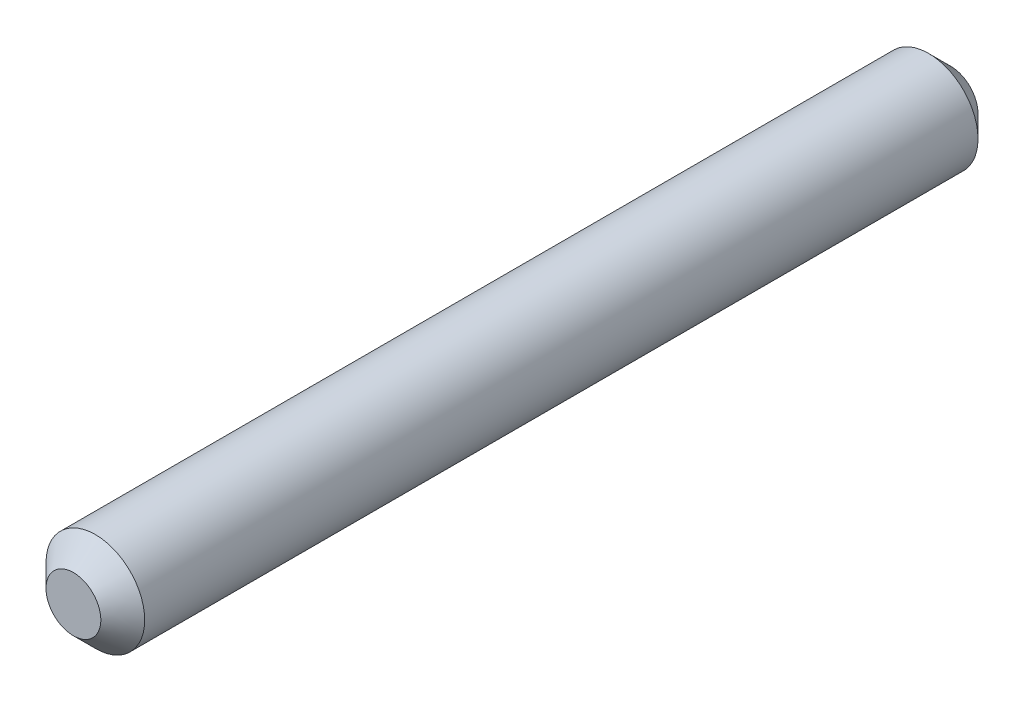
ISO-10303-21;
HEADER;
FILE_DESCRIPTION(('STEP AP214'),'2;1');
FILE_NAME('part.step','',(''),(''),'','','');
FILE_SCHEMA(('AUTOMOTIVE_DESIGN { 1 0 10303 214 1 1 1 1 }'));
ENDSEC;
DATA;
#1=APPLICATION_CONTEXT('core data for automotive mechanical design processes');
#2=APPLICATION_PROTOCOL_DEFINITION('international standard','automotive_design',2000,#1);
#3=PRODUCT_CONTEXT('',#1,'mechanical');
#4=PRODUCT('Part','Part','',(#3));
#5=PRODUCT_RELATED_PRODUCT_CATEGORY('part','',(#4));
#6=PRODUCT_DEFINITION_FORMATION('','',#4);
#7=PRODUCT_DEFINITION_CONTEXT('part definition',#1,'design');
#8=PRODUCT_DEFINITION('design','',#6,#7);
#9=PRODUCT_DEFINITION_SHAPE('','',#8);
#10=(LENGTH_UNIT() NAMED_UNIT(*) SI_UNIT(.MILLI.,.METRE.));
#11=(NAMED_UNIT(*) PLANE_ANGLE_UNIT() SI_UNIT($,.RADIAN.));
#12=(NAMED_UNIT(*) SI_UNIT($,.STERADIAN.) SOLID_ANGLE_UNIT());
#13=UNCERTAINTY_MEASURE_WITH_UNIT(LENGTH_MEASURE(1.E-05),#10,'distance_accuracy_value','');
#14=(GEOMETRIC_REPRESENTATION_CONTEXT(3) GLOBAL_UNCERTAINTY_ASSIGNED_CONTEXT((#13)) GLOBAL_UNIT_ASSIGNED_CONTEXT((#10,
#11,#12)) REPRESENTATION_CONTEXT('',''));
#15=CARTESIAN_POINT('',(0.,0.,0.));
#16=DIRECTION('',(0.,0.,1.));
#17=DIRECTION('',(1.,0.,0.));
#18=AXIS2_PLACEMENT_3D('',#15,#16,#17);
#19=CARTESIAN_POINT('',(0.,0.,40.));
#20=DIRECTION('',(0.,0.,-1.));
#21=DIRECTION('',(-1.,0.,0.));
#22=AXIS2_PLACEMENT_3D('',#19,#20,#21);
#23=PLANE('',#22);
#24=CARTESIAN_POINT('',(0.,0.,40.0000000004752));
#25=DIRECTION('',(0.,0.,-1.));
#26=DIRECTION('',(-1.,0.,0.));
#27=AXIS2_PLACEMENT_3D('',#24,#25,#26);
#28=CIRCLE('',#27,1.25000000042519);
#29=CARTESIAN_POINT('',(-1.25000000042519,0.,40.0000000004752));
#30=VERTEX_POINT('',#29);
#31=EDGE_CURVE('E16',#30,#30,#28,.T.);
#32=ORIENTED_EDGE('',*,*,#31,.F.);
#33=EDGE_LOOP('',(#32));
#34=FACE_BOUND('',#33,.T.);
#35=ADVANCED_FACE('F13',(#34),#23,.F.);
#36=CARTESIAN_POINT('',(0.,0.,0.));
#37=DIRECTION('',(0.,0.,-1.));
#38=DIRECTION('',(-1.,0.,0.));
#39=AXIS2_PLACEMENT_3D('',#36,#37,#38);
#40=PLANE('',#39);
#41=CARTESIAN_POINT('',(0.,0.,-4.54747350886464E-10));
#42=DIRECTION('',(0.,0.,1.));
#43=DIRECTION('',(1.,0.,0.));
#44=AXIS2_PLACEMENT_3D('',#41,#42,#43);
#45=CIRCLE('',#44,1.25000000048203);
#46=CARTESIAN_POINT('',(1.25000000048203,0.,-4.54747350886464E-10));
#47=VERTEX_POINT('',#46);
#48=EDGE_CURVE('E25',#47,#47,#45,.T.);
#49=ORIENTED_EDGE('',*,*,#48,.F.);
#50=EDGE_LOOP('',(#49));
#51=FACE_BOUND('',#50,.T.);
#52=ADVANCED_FACE('F40',(#51),#40,.T.);
#53=CARTESIAN_POINT('',(0.,0.,38.9999999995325));
#54=DIRECTION('',(0.,0.,-1.));
#55=DIRECTION('',(-1.,0.,0.));
#56=AXIS2_PLACEMENT_3D('',#53,#54,#55);
#57=CONICAL_SURFACE('',#56,2.24999999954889,0.785398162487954);
#58=CARTESIAN_POINT('',(0.,0.,39.));
#59=DIRECTION('',(0.,0.,1.));
#60=DIRECTION('',(1.,0.,0.));
#61=AXIS2_PLACEMENT_3D('',#58,#59,#60);
#62=CIRCLE('',#61,2.25);
#63=CARTESIAN_POINT('',(2.25,0.,39.));
#64=VERTEX_POINT('',#63);
#65=EDGE_CURVE('E20',#64,#64,#62,.F.);
#66=ORIENTED_EDGE('',*,*,#65,.F.);
#67=EDGE_LOOP('',(#66));
#68=FACE_BOUND('',#67,.T.);
#69=ORIENTED_EDGE('',*,*,#31,.T.);
#70=EDGE_LOOP('',(#69));
#71=FACE_BOUND('',#70,.T.);
#72=ADVANCED_FACE('F37',(#68,#71),#57,.T.);
#73=CARTESIAN_POINT('',(0.,0.,1.00000000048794));
#74=DIRECTION('',(0.,0.,1.));
#75=DIRECTION('',(1.,0.,0.));
#76=AXIS2_PLACEMENT_3D('',#73,#74,#75);
#77=CONICAL_SURFACE('',#76,2.24999999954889,0.785398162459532);
#78=ORIENTED_EDGE('',*,*,#48,.T.);
#79=EDGE_LOOP('',(#78));
#80=FACE_BOUND('',#79,.T.);
#81=CARTESIAN_POINT('',(0.,0.,1.));
#82=DIRECTION('',(0.,0.,1.));
#83=DIRECTION('',(1.,0.,0.));
#84=AXIS2_PLACEMENT_3D('',#81,#82,#83);
#85=CIRCLE('',#84,2.25);
#86=CARTESIAN_POINT('',(2.25,0.,1.));
#87=VERTEX_POINT('',#86);
#88=EDGE_CURVE('E9',#87,#87,#85,.T.);
#89=ORIENTED_EDGE('',*,*,#88,.F.);
#90=EDGE_LOOP('',(#89));
#91=FACE_BOUND('',#90,.T.);
#92=ADVANCED_FACE('F48',(#80,#91),#77,.T.);
#93=CARTESIAN_POINT('',(0.,0.,0.));
#94=DIRECTION('',(0.,0.,1.));
#95=DIRECTION('',(1.,0.,0.));
#96=AXIS2_PLACEMENT_3D('',#93,#94,#95);
#97=CYLINDRICAL_SURFACE('',#96,2.25);
#98=ORIENTED_EDGE('',*,*,#88,.T.);
#99=EDGE_LOOP('',(#98));
#100=FACE_BOUND('',#99,.T.);
#101=ORIENTED_EDGE('',*,*,#65,.T.);
#102=EDGE_LOOP('',(#101));
#103=FACE_BOUND('',#102,.T.);
#104=ADVANCED_FACE('F46',(#100,#103),#97,.T.);
#105=CLOSED_SHELL('',(#35,#52,#72,#92,#104));
#106=MANIFOLD_SOLID_BREP('B1',#105);
#107=ADVANCED_BREP_SHAPE_REPRESENTATION('',(#18,#106),#14);
#108=SHAPE_DEFINITION_REPRESENTATION(#9,#107);
ENDSEC;
END-ISO-10303-21;
